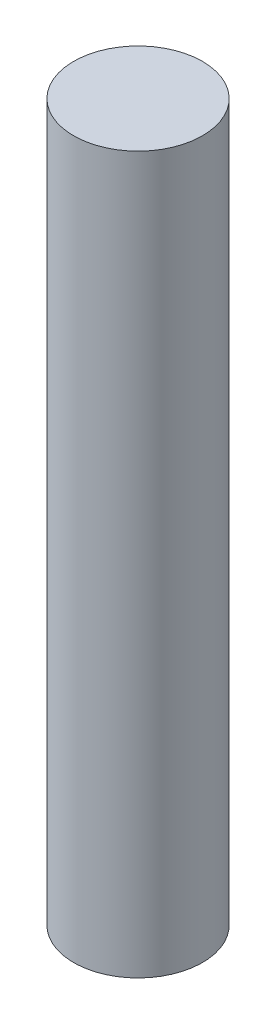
ISO-10303-21;
HEADER;
FILE_DESCRIPTION(('STEP AP214'),'2;1');
FILE_NAME('part.step','',(''),(''),'','','');
FILE_SCHEMA(('AUTOMOTIVE_DESIGN { 1 0 10303 214 1 1 1 1 }'));
ENDSEC;
DATA;
#1=APPLICATION_CONTEXT('core data for automotive mechanical design processes');
#2=APPLICATION_PROTOCOL_DEFINITION('international standard','automotive_design',2000,#1);
#3=PRODUCT_CONTEXT('',#1,'mechanical');
#4=PRODUCT('Part','Part','',(#3));
#5=PRODUCT_RELATED_PRODUCT_CATEGORY('part','',(#4));
#6=PRODUCT_DEFINITION_FORMATION('','',#4);
#7=PRODUCT_DEFINITION_CONTEXT('part definition',#1,'design');
#8=PRODUCT_DEFINITION('design','',#6,#7);
#9=PRODUCT_DEFINITION_SHAPE('','',#8);
#10=(LENGTH_UNIT() NAMED_UNIT(*) SI_UNIT(.MILLI.,.METRE.));
#11=(NAMED_UNIT(*) PLANE_ANGLE_UNIT() SI_UNIT($,.RADIAN.));
#12=(NAMED_UNIT(*) SI_UNIT($,.STERADIAN.) SOLID_ANGLE_UNIT());
#13=UNCERTAINTY_MEASURE_WITH_UNIT(LENGTH_MEASURE(1.E-05),#10,'distance_accuracy_value','');
#14=(GEOMETRIC_REPRESENTATION_CONTEXT(3) GLOBAL_UNCERTAINTY_ASSIGNED_CONTEXT((#13)) GLOBAL_UNIT_ASSIGNED_CONTEXT((#10,
#11,#12)) REPRESENTATION_CONTEXT('',''));
#15=CARTESIAN_POINT('',(0.,0.,0.));
#16=DIRECTION('',(0.,0.,1.));
#17=DIRECTION('',(1.,0.,0.));
#18=AXIS2_PLACEMENT_3D('',#15,#16,#17);
#19=CARTESIAN_POINT('',(0.,50.,0.));
#20=DIRECTION('',(0.,-1.,0.));
#21=DIRECTION('',(0.,0.,-1.));
#22=AXIS2_PLACEMENT_3D('',#19,#20,#21);
#23=CYLINDRICAL_SURFACE('',#22,4.5);
#24=CARTESIAN_POINT('',(0.,50.,0.));
#25=DIRECTION('',(0.,-1.,0.));
#26=DIRECTION('',(0.,0.,-1.));
#27=AXIS2_PLACEMENT_3D('',#24,#25,#26);
#28=CIRCLE('',#27,4.5);
#29=CARTESIAN_POINT('',(0.,50.,-4.5));
#30=VERTEX_POINT('',#29);
#31=EDGE_CURVE('E10',#30,#30,#28,.T.);
#32=ORIENTED_EDGE('',*,*,#31,.T.);
#33=EDGE_LOOP('',(#32));
#34=FACE_BOUND('',#33,.T.);
#35=CARTESIAN_POINT('',(0.,0.,0.));
#36=DIRECTION('',(0.,-1.,0.));
#37=DIRECTION('',(0.,0.,-1.));
#38=AXIS2_PLACEMENT_3D('',#35,#36,#37);
#39=CIRCLE('',#38,4.5);
#40=CARTESIAN_POINT('',(0.,0.,-4.5));
#41=VERTEX_POINT('',#40);
#42=EDGE_CURVE('E35',#41,#41,#39,.T.);
#43=ORIENTED_EDGE('',*,*,#42,.F.);
#44=EDGE_LOOP('',(#43));
#45=FACE_BOUND('',#44,.T.);
#46=ADVANCED_FACE('F29',(#34,#45),#23,.T.);
#47=CARTESIAN_POINT('',(4.5,50.,0.));
#48=DIRECTION('',(0.,1.,0.));
#49=DIRECTION('',(0.,0.,1.));
#50=AXIS2_PLACEMENT_3D('',#47,#48,#49);
#51=PLANE('',#50);
#52=ORIENTED_EDGE('',*,*,#31,.F.);
#53=EDGE_LOOP('',(#52));
#54=FACE_BOUND('',#53,.T.);
#55=ADVANCED_FACE('F44',(#54),#51,.T.);
#56=CARTESIAN_POINT('',(0.,0.,0.));
#57=DIRECTION('',(0.,-1.,0.));
#58=DIRECTION('',(0.,0.,-1.));
#59=AXIS2_PLACEMENT_3D('',#56,#57,#58);
#60=PLANE('',#59);
#61=ORIENTED_EDGE('',*,*,#42,.T.);
#62=EDGE_LOOP('',(#61));
#63=FACE_BOUND('',#62,.T.);
#64=ADVANCED_FACE('F41',(#63),#60,.T.);
#65=CLOSED_SHELL('',(#46,#55,#64));
#66=MANIFOLD_SOLID_BREP('B2',#65);
#67=ADVANCED_BREP_SHAPE_REPRESENTATION('',(#18,#66),#14);
#68=SHAPE_DEFINITION_REPRESENTATION(#9,#67);
ENDSEC;
END-ISO-10303-21;
